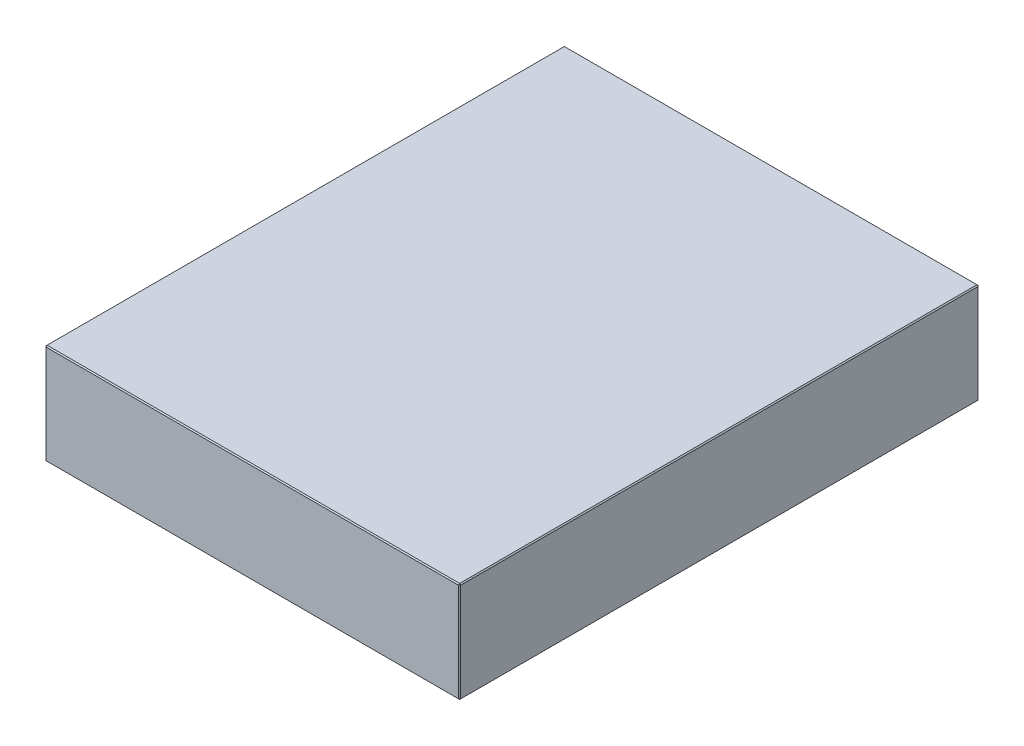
ISO-10303-21;
HEADER;
FILE_DESCRIPTION(('STEP AP214'),'2;1');
FILE_NAME('part.step','',(''),(''),'','','');
FILE_SCHEMA(('AUTOMOTIVE_DESIGN { 1 0 10303 214 1 1 1 1 }'));
ENDSEC;
DATA;
#1=APPLICATION_CONTEXT('core data for automotive mechanical design processes');
#2=APPLICATION_PROTOCOL_DEFINITION('international standard','automotive_design',2000,#1);
#3=PRODUCT_CONTEXT('',#1,'mechanical');
#4=PRODUCT('Part','Part','',(#3));
#5=PRODUCT_RELATED_PRODUCT_CATEGORY('part','',(#4));
#6=PRODUCT_DEFINITION_FORMATION('','',#4);
#7=PRODUCT_DEFINITION_CONTEXT('part definition',#1,'design');
#8=PRODUCT_DEFINITION('design','',#6,#7);
#9=PRODUCT_DEFINITION_SHAPE('','',#8);
#10=(LENGTH_UNIT() NAMED_UNIT(*) SI_UNIT(.MILLI.,.METRE.));
#11=(NAMED_UNIT(*) PLANE_ANGLE_UNIT() SI_UNIT($,.RADIAN.));
#12=(NAMED_UNIT(*) SI_UNIT($,.STERADIAN.) SOLID_ANGLE_UNIT());
#13=UNCERTAINTY_MEASURE_WITH_UNIT(LENGTH_MEASURE(1.E-05),#10,'distance_accuracy_value','');
#14=(GEOMETRIC_REPRESENTATION_CONTEXT(3) GLOBAL_UNCERTAINTY_ASSIGNED_CONTEXT((#13)) GLOBAL_UNIT_ASSIGNED_CONTEXT((#10,
#11,#12)) REPRESENTATION_CONTEXT('',''));
#15=CARTESIAN_POINT('',(0.,0.,0.));
#16=DIRECTION('',(0.,0.,1.));
#17=DIRECTION('',(1.,0.,0.));
#18=AXIS2_PLACEMENT_3D('',#15,#16,#17);
#19=CARTESIAN_POINT('',(-198.,96.,248.));
#20=DIRECTION('',(1.,0.,0.));
#21=DIRECTION('',(0.,0.,-1.));
#22=AXIS2_PLACEMENT_3D('',#19,#20,#21);
#23=PLANE('',#22);
#24=DIRECTION('',(0.,-1.,0.));
#25=VECTOR('',#24,1.);
#26=CARTESIAN_POINT('',(-198.,96.,-247.));
#27=LINE('',#26,#25);
#28=CARTESIAN_POINT('',(-198.,95.,-247.));
#29=VERTEX_POINT('',#28);
#30=CARTESIAN_POINT('',(-198.,1.,-247.));
#31=VERTEX_POINT('',#30);
#32=EDGE_CURVE('E114',#29,#31,#27,.T.);
#33=ORIENTED_EDGE('',*,*,#32,.T.);
#34=DIRECTION('',(0.,0.,1.));
#35=VECTOR('',#34,1.);
#36=CARTESIAN_POINT('',(-198.,1.,248.));
#37=LINE('',#36,#35);
#38=CARTESIAN_POINT('',(-198.,1.,247.));
#39=VERTEX_POINT('',#38);
#40=EDGE_CURVE('E110',#31,#39,#37,.T.);
#41=ORIENTED_EDGE('',*,*,#40,.T.);
#42=DIRECTION('',(0.,1.,0.));
#43=VECTOR('',#42,1.);
#44=CARTESIAN_POINT('',(-198.,96.,247.));
#45=LINE('',#44,#43);
#46=CARTESIAN_POINT('',(-198.,95.,247.));
#47=VERTEX_POINT('',#46);
#48=EDGE_CURVE('E103',#39,#47,#45,.T.);
#49=ORIENTED_EDGE('',*,*,#48,.T.);
#50=DIRECTION('',(0.,0.,-1.));
#51=VECTOR('',#50,1.);
#52=CARTESIAN_POINT('',(-198.,95.,-248.));
#53=LINE('',#52,#51);
#54=EDGE_CURVE('E107',#47,#29,#53,.T.);
#55=ORIENTED_EDGE('',*,*,#54,.T.);
#56=EDGE_LOOP('',(#33,#41,#49,#55));
#57=FACE_BOUND('',#56,.T.);
#58=ADVANCED_FACE('F15',(#57),#23,.F.);
#59=CARTESIAN_POINT('',(198.,96.,248.));
#60=DIRECTION('',(0.,0.,-1.));
#61=DIRECTION('',(-1.,0.,0.));
#62=AXIS2_PLACEMENT_3D('',#59,#60,#61);
#63=PLANE('',#62);
#64=DIRECTION('',(-1.,0.,0.));
#65=VECTOR('',#64,1.);
#66=CARTESIAN_POINT('',(-198.,95.,248.));
#67=LINE('',#66,#65);
#68=CARTESIAN_POINT('',(197.,95.,248.));
#69=VERTEX_POINT('',#68);
#70=CARTESIAN_POINT('',(-197.,95.,248.));
#71=VERTEX_POINT('',#70);
#72=EDGE_CURVE('E164',#69,#71,#67,.T.);
#73=ORIENTED_EDGE('',*,*,#72,.T.);
#74=DIRECTION('',(0.,-1.,0.));
#75=VECTOR('',#74,1.);
#76=CARTESIAN_POINT('',(-197.,96.,248.));
#77=LINE('',#76,#75);
#78=CARTESIAN_POINT('',(-197.,0.999999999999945,248.));
#79=VERTEX_POINT('',#78);
#80=EDGE_CURVE('E122',#71,#79,#77,.T.);
#81=ORIENTED_EDGE('',*,*,#80,.T.);
#82=DIRECTION('',(1.,0.,0.));
#83=VECTOR('',#82,1.);
#84=CARTESIAN_POINT('',(198.,0.999999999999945,248.));
#85=LINE('',#84,#83);
#86=CARTESIAN_POINT('',(197.,0.999999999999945,248.));
#87=VERTEX_POINT('',#86);
#88=EDGE_CURVE('E168',#79,#87,#85,.T.);
#89=ORIENTED_EDGE('',*,*,#88,.T.);
#90=DIRECTION('',(0.,1.,0.));
#91=VECTOR('',#90,1.);
#92=CARTESIAN_POINT('',(197.,96.,248.));
#93=LINE('',#92,#91);
#94=EDGE_CURVE('E166',#87,#69,#93,.T.);
#95=ORIENTED_EDGE('',*,*,#94,.T.);
#96=EDGE_LOOP('',(#73,#81,#89,#95));
#97=FACE_BOUND('',#96,.T.);
#98=ADVANCED_FACE('F275',(#97),#63,.F.);
#99=CARTESIAN_POINT('',(198.,96.,248.));
#100=DIRECTION('',(-1.,0.,0.));
#101=DIRECTION('',(0.,0.,1.));
#102=AXIS2_PLACEMENT_3D('',#99,#100,#101);
#103=PLANE('',#102);
#104=DIRECTION('',(0.,0.,-1.));
#105=VECTOR('',#104,1.);
#106=CARTESIAN_POINT('',(198.,0.999999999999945,248.));
#107=LINE('',#106,#105);
#108=CARTESIAN_POINT('',(198.,0.999999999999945,247.));
#109=VERTEX_POINT('',#108);
#110=CARTESIAN_POINT('',(198.,0.999999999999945,-247.));
#111=VERTEX_POINT('',#110);
#112=EDGE_CURVE('E159',#109,#111,#107,.T.);
#113=ORIENTED_EDGE('',*,*,#112,.T.);
#114=DIRECTION('',(0.,1.,0.));
#115=VECTOR('',#114,1.);
#116=CARTESIAN_POINT('',(198.,96.,-247.));
#117=LINE('',#116,#115);
#118=CARTESIAN_POINT('',(198.,95.,-247.));
#119=VERTEX_POINT('',#118);
#120=EDGE_CURVE('E161',#111,#119,#117,.T.);
#121=ORIENTED_EDGE('',*,*,#120,.T.);
#122=DIRECTION('',(0.,0.,1.));
#123=VECTOR('',#122,1.);
#124=CARTESIAN_POINT('',(198.,95.,248.));
#125=LINE('',#124,#123);
#126=CARTESIAN_POINT('',(198.,95.,247.));
#127=VERTEX_POINT('',#126);
#128=EDGE_CURVE('E155',#119,#127,#125,.T.);
#129=ORIENTED_EDGE('',*,*,#128,.T.);
#130=DIRECTION('',(0.,-1.,0.));
#131=VECTOR('',#130,1.);
#132=CARTESIAN_POINT('',(198.,96.,247.));
#133=LINE('',#132,#131);
#134=EDGE_CURVE('E157',#127,#109,#133,.T.);
#135=ORIENTED_EDGE('',*,*,#134,.T.);
#136=EDGE_LOOP('',(#113,#121,#129,#135));
#137=FACE_BOUND('',#136,.T.);
#138=ADVANCED_FACE('F254',(#137),#103,.F.);
#139=CARTESIAN_POINT('',(198.,96.,-248.));
#140=DIRECTION('',(0.,0.,1.));
#141=DIRECTION('',(1.,0.,0.));
#142=AXIS2_PLACEMENT_3D('',#139,#140,#141);
#143=PLANE('',#142);
#144=DIRECTION('',(0.,-1.,0.));
#145=VECTOR('',#144,1.);
#146=CARTESIAN_POINT('',(197.,96.,-248.));
#147=LINE('',#146,#145);
#148=CARTESIAN_POINT('',(197.,95.,-248.));
#149=VERTEX_POINT('',#148);
#150=CARTESIAN_POINT('',(197.,0.999999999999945,-248.));
#151=VERTEX_POINT('',#150);
#152=EDGE_CURVE('E148',#149,#151,#147,.T.);
#153=ORIENTED_EDGE('',*,*,#152,.T.);
#154=DIRECTION('',(-1.,0.,0.));
#155=VECTOR('',#154,1.);
#156=CARTESIAN_POINT('',(198.,0.999999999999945,-248.));
#157=LINE('',#156,#155);
#158=CARTESIAN_POINT('',(-197.,0.999999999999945,-248.));
#159=VERTEX_POINT('',#158);
#160=EDGE_CURVE('E153',#151,#159,#157,.T.);
#161=ORIENTED_EDGE('',*,*,#160,.T.);
#162=DIRECTION('',(0.,1.,0.));
#163=VECTOR('',#162,1.);
#164=CARTESIAN_POINT('',(-197.,96.,-248.));
#165=LINE('',#164,#163);
#166=CARTESIAN_POINT('',(-197.,95.,-248.));
#167=VERTEX_POINT('',#166);
#168=EDGE_CURVE('E150',#159,#167,#165,.T.);
#169=ORIENTED_EDGE('',*,*,#168,.T.);
#170=DIRECTION('',(1.,0.,0.));
#171=VECTOR('',#170,1.);
#172=CARTESIAN_POINT('',(198.,95.,-248.));
#173=LINE('',#172,#171);
#174=EDGE_CURVE('E146',#167,#149,#173,.T.);
#175=ORIENTED_EDGE('',*,*,#174,.T.);
#176=EDGE_LOOP('',(#153,#161,#169,#175));
#177=FACE_BOUND('',#176,.T.);
#178=ADVANCED_FACE('F284',(#177),#143,.F.);
#179=CARTESIAN_POINT('',(0.,96.,0.));
#180=DIRECTION('',(0.,1.,0.));
#181=DIRECTION('',(0.,0.,1.));
#182=AXIS2_PLACEMENT_3D('',#179,#180,#181);
#183=PLANE('',#182);
#184=DIRECTION('',(0.,0.,-1.));
#185=VECTOR('',#184,1.);
#186=CARTESIAN_POINT('',(197.,96.,-248.));
#187=LINE('',#186,#185);
#188=CARTESIAN_POINT('',(197.,96.,247.));
#189=VERTEX_POINT('',#188);
#190=CARTESIAN_POINT('',(197.,96.,-247.));
#191=VERTEX_POINT('',#190);
#192=EDGE_CURVE('E24',#189,#191,#187,.T.);
#193=ORIENTED_EDGE('',*,*,#192,.T.);
#194=DIRECTION('',(-1.,0.,0.));
#195=VECTOR('',#194,1.);
#196=CARTESIAN_POINT('',(-198.,96.,-247.));
#197=LINE('',#196,#195);
#198=CARTESIAN_POINT('',(-197.,96.,-247.));
#199=VERTEX_POINT('',#198);
#200=EDGE_CURVE('E9',#191,#199,#197,.T.);
#201=ORIENTED_EDGE('',*,*,#200,.T.);
#202=DIRECTION('',(0.,0.,1.));
#203=VECTOR('',#202,1.);
#204=CARTESIAN_POINT('',(-197.,96.,248.));
#205=LINE('',#204,#203);
#206=CARTESIAN_POINT('',(-197.,96.,247.));
#207=VERTEX_POINT('',#206);
#208=EDGE_CURVE('E180',#199,#207,#205,.T.);
#209=ORIENTED_EDGE('',*,*,#208,.T.);
#210=DIRECTION('',(1.,0.,0.));
#211=VECTOR('',#210,1.);
#212=CARTESIAN_POINT('',(198.,96.,247.));
#213=LINE('',#212,#211);
#214=EDGE_CURVE('E35',#207,#189,#213,.T.);
#215=ORIENTED_EDGE('',*,*,#214,.T.);
#216=EDGE_LOOP('',(#193,#201,#209,#215));
#217=FACE_BOUND('',#216,.T.);
#218=ADVANCED_FACE('F350',(#217),#183,.T.);
#219=CARTESIAN_POINT('',(0.,0.,0.));
#220=DIRECTION('',(0.,1.,0.));
#221=DIRECTION('',(0.,0.,1.));
#222=AXIS2_PLACEMENT_3D('',#219,#220,#221);
#223=PLANE('',#222);
#224=DIRECTION('',(0.,0.,1.));
#225=VECTOR('',#224,1.);
#226=CARTESIAN_POINT('',(197.,0.,0.));
#227=LINE('',#226,#225);
#228=CARTESIAN_POINT('',(197.,0.,-247.));
#229=VERTEX_POINT('',#228);
#230=CARTESIAN_POINT('',(197.,0.,247.));
#231=VERTEX_POINT('',#230);
#232=EDGE_CURVE('E171',#229,#231,#227,.T.);
#233=ORIENTED_EDGE('',*,*,#232,.T.);
#234=DIRECTION('',(-1.,0.,0.));
#235=VECTOR('',#234,1.);
#236=CARTESIAN_POINT('',(0.,0.,247.));
#237=LINE('',#236,#235);
#238=CARTESIAN_POINT('',(-197.,0.,247.));
#239=VERTEX_POINT('',#238);
#240=EDGE_CURVE('E177',#231,#239,#237,.T.);
#241=ORIENTED_EDGE('',*,*,#240,.T.);
#242=DIRECTION('',(0.,0.,-1.));
#243=VECTOR('',#242,1.);
#244=CARTESIAN_POINT('',(-197.,0.,0.));
#245=LINE('',#244,#243);
#246=CARTESIAN_POINT('',(-197.,0.,-247.));
#247=VERTEX_POINT('',#246);
#248=EDGE_CURVE('E175',#239,#247,#245,.T.);
#249=ORIENTED_EDGE('',*,*,#248,.T.);
#250=DIRECTION('',(1.,0.,0.));
#251=VECTOR('',#250,1.);
#252=CARTESIAN_POINT('',(0.,0.,-247.));
#253=LINE('',#252,#251);
#254=EDGE_CURVE('E173',#247,#229,#253,.T.);
#255=ORIENTED_EDGE('',*,*,#254,.T.);
#256=EDGE_LOOP('',(#233,#241,#249,#255));
#257=FACE_BOUND('',#256,.T.);
#258=ADVANCED_FACE('F246',(#257),#223,.F.);
#259=CARTESIAN_POINT('',(198.,96.,247.));
#260=DIRECTION('',(-0.707106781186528,0.,-0.707106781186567));
#261=DIRECTION('',(0.,-1.,0.));
#262=AXIS2_PLACEMENT_3D('',#259,#260,#261);
#263=PLANE('',#262);
#264=DIRECTION('',(-0.707106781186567,0.,0.707106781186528));
#265=VECTOR('',#264,1.);
#266=CARTESIAN_POINT('',(197.,95.,248.));
#267=LINE('',#266,#265);
#268=EDGE_CURVE('E19',#69,#127,#267,.F.);
#269=ORIENTED_EDGE('',*,*,#268,.F.);
#270=ORIENTED_EDGE('',*,*,#94,.F.);
#271=DIRECTION('',(0.707106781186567,0.,-0.707106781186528));
#272=VECTOR('',#271,1.);
#273=CARTESIAN_POINT('',(197.,0.999999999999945,248.));
#274=LINE('',#273,#272);
#275=EDGE_CURVE('E142',#109,#87,#274,.F.);
#276=ORIENTED_EDGE('',*,*,#275,.F.);
#277=ORIENTED_EDGE('',*,*,#134,.F.);
#278=EDGE_LOOP('',(#269,#270,#276,#277));
#279=FACE_BOUND('',#278,.T.);
#280=ADVANCED_FACE('F17',(#279),#263,.F.);
#281=CARTESIAN_POINT('',(197.,95.,248.));
#282=DIRECTION('',(0.577350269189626,0.577350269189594,0.577350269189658));
#283=DIRECTION('',(0.707106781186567,0.,-0.707106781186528));
#284=AXIS2_PLACEMENT_3D('',#281,#282,#283);
#285=PLANE('',#284);
#286=DIRECTION('',(0.,-0.707106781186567,0.707106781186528));
#287=VECTOR('',#286,1.);
#288=CARTESIAN_POINT('',(197.,95.,248.));
#289=LINE('',#288,#287);
#290=EDGE_CURVE('E226',#69,#189,#289,.F.);
#291=ORIENTED_EDGE('',*,*,#290,.F.);
#292=ORIENTED_EDGE('',*,*,#268,.T.);
#293=DIRECTION('',(-0.707106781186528,0.707106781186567,0.));
#294=VECTOR('',#293,1.);
#295=CARTESIAN_POINT('',(197.5,95.5,247.));
#296=LINE('',#295,#294);
#297=EDGE_CURVE('E228',#189,#127,#296,.F.);
#298=ORIENTED_EDGE('',*,*,#297,.F.);
#299=EDGE_LOOP('',(#291,#292,#298));
#300=FACE_BOUND('',#299,.T.);
#301=ADVANCED_FACE('F270',(#300),#285,.T.);
#302=CARTESIAN_POINT('',(197.,0.999999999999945,248.));
#303=DIRECTION('',(0.577350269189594,-0.577350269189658,0.577350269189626));
#304=DIRECTION('',(0.,-0.707106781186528,-0.707106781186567));
#305=AXIS2_PLACEMENT_3D('',#302,#303,#304);
#306=PLANE('',#305);
#307=DIRECTION('',(-0.707106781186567,-0.707106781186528,0.));
#308=VECTOR('',#307,1.);
#309=CARTESIAN_POINT('',(197.5,0.499999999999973,247.));
#310=LINE('',#309,#308);
#311=EDGE_CURVE('E220',#109,#231,#310,.T.);
#312=ORIENTED_EDGE('',*,*,#311,.F.);
#313=ORIENTED_EDGE('',*,*,#275,.T.);
#314=DIRECTION('',(0.,0.707106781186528,0.707106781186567));
#315=VECTOR('',#314,1.);
#316=CARTESIAN_POINT('',(197.,0.999999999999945,248.));
#317=LINE('',#316,#315);
#318=EDGE_CURVE('E223',#231,#87,#317,.T.);
#319=ORIENTED_EDGE('',*,*,#318,.F.);
#320=EDGE_LOOP('',(#312,#313,#319));
#321=FACE_BOUND('',#320,.T.);
#322=ADVANCED_FACE('F235',(#321),#306,.T.);
#323=CARTESIAN_POINT('',(197.,96.,0.));
#324=DIRECTION('',(0.707106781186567,0.707106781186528,0.));
#325=DIRECTION('',(0.,0.,1.));
#326=AXIS2_PLACEMENT_3D('',#323,#324,#325);
#327=PLANE('',#326);
#328=ORIENTED_EDGE('',*,*,#297,.T.);
#329=ORIENTED_EDGE('',*,*,#128,.F.);
#330=DIRECTION('',(0.707106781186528,-0.707106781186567,0.));
#331=VECTOR('',#330,1.);
#332=CARTESIAN_POINT('',(198.,95.,-247.));
#333=LINE('',#332,#331);
#334=EDGE_CURVE('E215',#191,#119,#333,.T.);
#335=ORIENTED_EDGE('',*,*,#334,.F.);
#336=ORIENTED_EDGE('',*,*,#192,.F.);
#337=EDGE_LOOP('',(#328,#329,#335,#336));
#338=FACE_BOUND('',#337,.T.);
#339=ADVANCED_FACE('F265',(#338),#327,.T.);
#340=CARTESIAN_POINT('',(0.,96.,247.));
#341=DIRECTION('',(0.,0.707106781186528,0.707106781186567));
#342=DIRECTION('',(-1.,0.,0.));
#343=AXIS2_PLACEMENT_3D('',#340,#341,#342);
#344=PLANE('',#343);
#345=ORIENTED_EDGE('',*,*,#290,.T.);
#346=ORIENTED_EDGE('',*,*,#214,.F.);
#347=DIRECTION('',(0.,0.707106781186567,-0.707106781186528));
#348=VECTOR('',#347,1.);
#349=CARTESIAN_POINT('',(-197.,95.5,247.5));
#350=LINE('',#349,#348);
#351=EDGE_CURVE('E126',#71,#207,#350,.T.);
#352=ORIENTED_EDGE('',*,*,#351,.F.);
#353=ORIENTED_EDGE('',*,*,#72,.F.);
#354=EDGE_LOOP('',(#345,#346,#352,#353));
#355=FACE_BOUND('',#354,.T.);
#356=ADVANCED_FACE('F273',(#355),#344,.T.);
#357=CARTESIAN_POINT('',(-197.,96.,248.));
#358=DIRECTION('',(0.707106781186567,0.,-0.707106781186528));
#359=DIRECTION('',(0.,-1.,0.));
#360=AXIS2_PLACEMENT_3D('',#357,#358,#359);
#361=PLANE('',#360);
#362=DIRECTION('',(0.707106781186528,0.,0.707106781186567));
#363=VECTOR('',#362,1.);
#364=CARTESIAN_POINT('',(-197.,0.999999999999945,248.));
#365=LINE('',#364,#363);
#366=EDGE_CURVE('E127',#79,#39,#365,.F.);
#367=ORIENTED_EDGE('',*,*,#366,.F.);
#368=ORIENTED_EDGE('',*,*,#80,.F.);
#369=DIRECTION('',(-0.707106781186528,0.,-0.707106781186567));
#370=VECTOR('',#369,1.);
#371=CARTESIAN_POINT('',(-198.,95.,247.));
#372=LINE('',#371,#370);
#373=EDGE_CURVE('E118',#47,#71,#372,.F.);
#374=ORIENTED_EDGE('',*,*,#373,.F.);
#375=ORIENTED_EDGE('',*,*,#48,.F.);
#376=EDGE_LOOP('',(#367,#368,#374,#375));
#377=FACE_BOUND('',#376,.T.);
#378=ADVANCED_FACE('F120',(#377),#361,.F.);
#379=CARTESIAN_POINT('',(198.,0.999999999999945,248.));
#380=DIRECTION('',(0.,0.707106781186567,-0.707106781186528));
#381=DIRECTION('',(1.,0.,0.));
#382=AXIS2_PLACEMENT_3D('',#379,#380,#381);
#383=PLANE('',#382);
#384=ORIENTED_EDGE('',*,*,#318,.T.);
#385=ORIENTED_EDGE('',*,*,#88,.F.);
#386=DIRECTION('',(0.,-0.707106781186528,-0.707106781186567));
#387=VECTOR('',#386,1.);
#388=CARTESIAN_POINT('',(-197.,0.999999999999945,248.));
#389=LINE('',#388,#387);
#390=EDGE_CURVE('E211',#239,#79,#389,.F.);
#391=ORIENTED_EDGE('',*,*,#390,.F.);
#392=ORIENTED_EDGE('',*,*,#240,.F.);
#393=EDGE_LOOP('',(#384,#385,#391,#392));
#394=FACE_BOUND('',#393,.T.);
#395=ADVANCED_FACE('F243',(#394),#383,.F.);
#396=CARTESIAN_POINT('',(198.,0.999999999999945,248.));
#397=DIRECTION('',(-0.707106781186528,0.707106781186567,0.));
#398=DIRECTION('',(0.,0.,-1.));
#399=AXIS2_PLACEMENT_3D('',#396,#397,#398);
#400=PLANE('',#399);
#401=ORIENTED_EDGE('',*,*,#311,.T.);
#402=ORIENTED_EDGE('',*,*,#232,.F.);
#403=DIRECTION('',(0.707106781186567,0.707106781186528,0.));
#404=VECTOR('',#403,1.);
#405=CARTESIAN_POINT('',(197.5,0.499999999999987,-247.));
#406=LINE('',#405,#404);
#407=EDGE_CURVE('E208',#111,#229,#406,.F.);
#408=ORIENTED_EDGE('',*,*,#407,.F.);
#409=ORIENTED_EDGE('',*,*,#112,.F.);
#410=EDGE_LOOP('',(#401,#402,#408,#409));
#411=FACE_BOUND('',#410,.T.);
#412=ADVANCED_FACE('F251',(#411),#400,.F.);
#413=CARTESIAN_POINT('',(197.,96.,-248.));
#414=DIRECTION('',(-0.707106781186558,0.,0.707106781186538));
#415=DIRECTION('',(0.,-1.,0.));
#416=AXIS2_PLACEMENT_3D('',#413,#414,#415);
#417=PLANE('',#416);
#418=DIRECTION('',(0.707106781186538,0.,0.707106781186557));
#419=VECTOR('',#418,1.);
#420=CARTESIAN_POINT('',(198.,95.,-247.));
#421=LINE('',#420,#419);
#422=EDGE_CURVE('E217',#119,#149,#421,.F.);
#423=ORIENTED_EDGE('',*,*,#422,.F.);
#424=ORIENTED_EDGE('',*,*,#120,.F.);
#425=DIRECTION('',(-0.707106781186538,0.,-0.707106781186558));
#426=VECTOR('',#425,1.);
#427=CARTESIAN_POINT('',(197.,0.999999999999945,-248.));
#428=LINE('',#427,#426);
#429=EDGE_CURVE('E205',#151,#111,#428,.F.);
#430=ORIENTED_EDGE('',*,*,#429,.F.);
#431=ORIENTED_EDGE('',*,*,#152,.F.);
#432=EDGE_LOOP('',(#423,#424,#430,#431));
#433=FACE_BOUND('',#432,.T.);
#434=ADVANCED_FACE('F258',(#433),#417,.F.);
#435=CARTESIAN_POINT('',(198.,95.,-247.));
#436=DIRECTION('',(0.577350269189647,0.577350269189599,-0.577350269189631));
#437=DIRECTION('',(-0.707106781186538,0.,-0.707106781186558));
#438=AXIS2_PLACEMENT_3D('',#435,#436,#437);
#439=PLANE('',#438);
#440=ORIENTED_EDGE('',*,*,#334,.T.);
#441=ORIENTED_EDGE('',*,*,#422,.T.);
#442=DIRECTION('',(0.,0.707106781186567,0.707106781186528));
#443=VECTOR('',#442,1.);
#444=CARTESIAN_POINT('',(197.,95.5,-247.5));
#445=LINE('',#444,#443);
#446=EDGE_CURVE('E134',#191,#149,#445,.F.);
#447=ORIENTED_EDGE('',*,*,#446,.F.);
#448=EDGE_LOOP('',(#440,#441,#447));
#449=FACE_BOUND('',#448,.T.);
#450=ADVANCED_FACE('F325',(#449),#439,.T.);
#451=CARTESIAN_POINT('',(-198.,95.,247.));
#452=DIRECTION('',(-0.577350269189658,0.577350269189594,0.577350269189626));
#453=DIRECTION('',(0.707106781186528,0.,0.707106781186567));
#454=AXIS2_PLACEMENT_3D('',#451,#452,#453);
#455=PLANE('',#454);
#456=ORIENTED_EDGE('',*,*,#373,.T.);
#457=ORIENTED_EDGE('',*,*,#351,.T.);
#458=DIRECTION('',(-0.707106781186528,-0.707106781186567,0.));
#459=VECTOR('',#458,1.);
#460=CARTESIAN_POINT('',(-198.,95.,247.));
#461=LINE('',#460,#459);
#462=EDGE_CURVE('E130',#47,#207,#461,.F.);
#463=ORIENTED_EDGE('',*,*,#462,.F.);
#464=EDGE_LOOP('',(#456,#457,#463));
#465=FACE_BOUND('',#464,.T.);
#466=ADVANCED_FACE('F131',(#465),#455,.T.);
#467=CARTESIAN_POINT('',(-197.,0.999999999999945,248.));
#468=DIRECTION('',(-0.577350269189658,-0.577350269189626,0.577350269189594));
#469=DIRECTION('',(0.707106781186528,-0.707106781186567,0.));
#470=AXIS2_PLACEMENT_3D('',#467,#468,#469);
#471=PLANE('',#470);
#472=ORIENTED_EDGE('',*,*,#390,.T.);
#473=ORIENTED_EDGE('',*,*,#366,.T.);
#474=DIRECTION('',(-0.707106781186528,0.707106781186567,0.));
#475=VECTOR('',#474,1.);
#476=CARTESIAN_POINT('',(-197.5,0.5,247.));
#477=LINE('',#476,#475);
#478=EDGE_CURVE('E135',#239,#39,#477,.T.);
#479=ORIENTED_EDGE('',*,*,#478,.F.);
#480=EDGE_LOOP('',(#472,#473,#479));
#481=FACE_BOUND('',#480,.T.);
#482=ADVANCED_FACE('F318',(#481),#471,.T.);
#483=CARTESIAN_POINT('',(197.,0.999999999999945,-248.));
#484=DIRECTION('',(0.577350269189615,-0.577350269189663,-0.577350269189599));
#485=DIRECTION('',(0.707106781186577,0.707106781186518,0.));
#486=AXIS2_PLACEMENT_3D('',#483,#484,#485);
#487=PLANE('',#486);
#488=ORIENTED_EDGE('',*,*,#429,.T.);
#489=ORIENTED_EDGE('',*,*,#407,.T.);
#490=DIRECTION('',(0.,-0.707106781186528,0.707106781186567));
#491=VECTOR('',#490,1.);
#492=CARTESIAN_POINT('',(197.,0.999999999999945,-248.));
#493=LINE('',#492,#491);
#494=EDGE_CURVE('E198',#151,#229,#493,.T.);
#495=ORIENTED_EDGE('',*,*,#494,.F.);
#496=EDGE_LOOP('',(#488,#489,#495));
#497=FACE_BOUND('',#496,.T.);
#498=ADVANCED_FACE('F314',(#497),#487,.T.);
#499=CARTESIAN_POINT('',(0.,96.,-247.));
#500=DIRECTION('',(0.,0.707106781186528,-0.707106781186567));
#501=DIRECTION('',(1.,0.,0.));
#502=AXIS2_PLACEMENT_3D('',#499,#500,#501);
#503=PLANE('',#502);
#504=ORIENTED_EDGE('',*,*,#446,.T.);
#505=ORIENTED_EDGE('',*,*,#174,.F.);
#506=DIRECTION('',(0.,-0.707106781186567,-0.707106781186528));
#507=VECTOR('',#506,1.);
#508=CARTESIAN_POINT('',(-197.,95.,-248.));
#509=LINE('',#508,#507);
#510=EDGE_CURVE('E195',#199,#167,#509,.T.);
#511=ORIENTED_EDGE('',*,*,#510,.F.);
#512=ORIENTED_EDGE('',*,*,#200,.F.);
#513=EDGE_LOOP('',(#504,#505,#511,#512));
#514=FACE_BOUND('',#513,.T.);
#515=ADVANCED_FACE('F311',(#514),#503,.T.);
#516=CARTESIAN_POINT('',(-197.,96.,0.));
#517=DIRECTION('',(-0.707106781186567,0.707106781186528,0.));
#518=DIRECTION('',(0.,0.,-1.));
#519=AXIS2_PLACEMENT_3D('',#516,#517,#518);
#520=PLANE('',#519);
#521=ORIENTED_EDGE('',*,*,#462,.T.);
#522=ORIENTED_EDGE('',*,*,#208,.F.);
#523=DIRECTION('',(0.707106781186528,0.707106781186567,0.));
#524=VECTOR('',#523,1.);
#525=CARTESIAN_POINT('',(-197.5,95.5,-247.));
#526=LINE('',#525,#524);
#527=EDGE_CURVE('E138',#29,#199,#526,.T.);
#528=ORIENTED_EDGE('',*,*,#527,.F.);
#529=ORIENTED_EDGE('',*,*,#54,.F.);
#530=EDGE_LOOP('',(#521,#522,#528,#529));
#531=FACE_BOUND('',#530,.T.);
#532=ADVANCED_FACE('F137',(#531),#520,.T.);
#533=CARTESIAN_POINT('',(-198.,1.,248.));
#534=DIRECTION('',(0.707106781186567,0.707106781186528,0.));
#535=DIRECTION('',(0.,0.,1.));
#536=AXIS2_PLACEMENT_3D('',#533,#534,#535);
#537=PLANE('',#536);
#538=ORIENTED_EDGE('',*,*,#478,.T.);
#539=ORIENTED_EDGE('',*,*,#40,.F.);
#540=DIRECTION('',(0.707106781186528,-0.707106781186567,0.));
#541=VECTOR('',#540,1.);
#542=CARTESIAN_POINT('',(-198.,1.,-247.));
#543=LINE('',#542,#541);
#544=EDGE_CURVE('E191',#247,#31,#543,.F.);
#545=ORIENTED_EDGE('',*,*,#544,.F.);
#546=ORIENTED_EDGE('',*,*,#248,.F.);
#547=EDGE_LOOP('',(#538,#539,#545,#546));
#548=FACE_BOUND('',#547,.T.);
#549=ADVANCED_FACE('F304',(#548),#537,.F.);
#550=CARTESIAN_POINT('',(198.,0.999999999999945,-248.));
#551=DIRECTION('',(0.,0.707106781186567,0.707106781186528));
#552=DIRECTION('',(-1.,0.,0.));
#553=AXIS2_PLACEMENT_3D('',#550,#551,#552);
#554=PLANE('',#553);
#555=ORIENTED_EDGE('',*,*,#494,.T.);
#556=ORIENTED_EDGE('',*,*,#254,.F.);
#557=DIRECTION('',(0.,0.707106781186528,-0.707106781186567));
#558=VECTOR('',#557,1.);
#559=CARTESIAN_POINT('',(-197.,0.499999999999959,-247.5));
#560=LINE('',#559,#558);
#561=EDGE_CURVE('E188',#159,#247,#560,.F.);
#562=ORIENTED_EDGE('',*,*,#561,.F.);
#563=ORIENTED_EDGE('',*,*,#160,.F.);
#564=EDGE_LOOP('',(#555,#556,#562,#563));
#565=FACE_BOUND('',#564,.T.);
#566=ADVANCED_FACE('F300',(#565),#554,.F.);
#567=CARTESIAN_POINT('',(-197.,95.,-248.));
#568=DIRECTION('',(-0.577350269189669,0.577350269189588,-0.57735026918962));
#569=DIRECTION('',(-0.707106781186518,0.,0.707106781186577));
#570=AXIS2_PLACEMENT_3D('',#567,#568,#569);
#571=PLANE('',#570);
#572=ORIENTED_EDGE('',*,*,#527,.T.);
#573=ORIENTED_EDGE('',*,*,#510,.T.);
#574=DIRECTION('',(0.707106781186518,0.,-0.707106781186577));
#575=VECTOR('',#574,1.);
#576=CARTESIAN_POINT('',(-197.,95.,-248.));
#577=LINE('',#576,#575);
#578=EDGE_CURVE('E186',#29,#167,#577,.T.);
#579=ORIENTED_EDGE('',*,*,#578,.F.);
#580=EDGE_LOOP('',(#572,#573,#579));
#581=FACE_BOUND('',#580,.T.);
#582=ADVANCED_FACE('F296',(#581),#571,.T.);
#583=CARTESIAN_POINT('',(-198.,1.,-247.));
#584=DIRECTION('',(-0.577350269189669,-0.57735026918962,-0.577350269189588));
#585=DIRECTION('',(0.707106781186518,-0.707106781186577,0.));
#586=AXIS2_PLACEMENT_3D('',#583,#584,#585);
#587=PLANE('',#586);
#588=ORIENTED_EDGE('',*,*,#561,.T.);
#589=ORIENTED_EDGE('',*,*,#544,.T.);
#590=DIRECTION('',(-0.707106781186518,0.,0.707106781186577));
#591=VECTOR('',#590,1.);
#592=CARTESIAN_POINT('',(-198.,1.,-247.));
#593=LINE('',#592,#591);
#594=EDGE_CURVE('E184',#159,#31,#593,.T.);
#595=ORIENTED_EDGE('',*,*,#594,.F.);
#596=EDGE_LOOP('',(#588,#589,#595));
#597=FACE_BOUND('',#596,.T.);
#598=ADVANCED_FACE('F292',(#597),#587,.T.);
#599=CARTESIAN_POINT('',(-198.,96.,-247.));
#600=DIRECTION('',(0.707106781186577,0.,0.707106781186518));
#601=DIRECTION('',(0.,-1.,0.));
#602=AXIS2_PLACEMENT_3D('',#599,#600,#601);
#603=PLANE('',#602);
#604=ORIENTED_EDGE('',*,*,#578,.T.);
#605=ORIENTED_EDGE('',*,*,#168,.F.);
#606=ORIENTED_EDGE('',*,*,#594,.T.);
#607=ORIENTED_EDGE('',*,*,#32,.F.);
#608=EDGE_LOOP('',(#604,#605,#606,#607));
#609=FACE_BOUND('',#608,.T.);
#610=ADVANCED_FACE('F289',(#609),#603,.F.);
#611=CLOSED_SHELL('',(#58,#98,#138,#178,#218,#258,#280,#301,#322,#339,#356,#378,#395,#412,#434,
#450,#466,#482,#498,#515,#532,#549,#566,#582,#598,#610));
#612=MANIFOLD_SOLID_BREP('B1',#611);
#613=ADVANCED_BREP_SHAPE_REPRESENTATION('',(#18,#612),#14);
#614=SHAPE_DEFINITION_REPRESENTATION(#9,#613);
ENDSEC;
END-ISO-10303-21;
